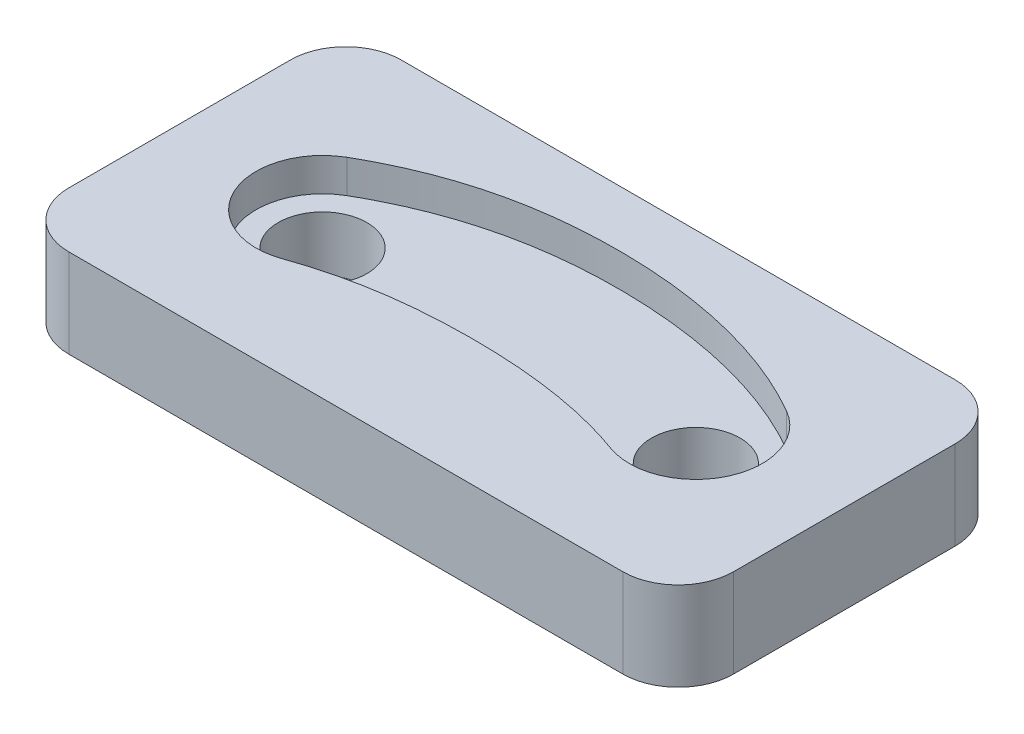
from build123d import *

# Parameters (mm, degrees)
EXTRUDE_1_DEPTH     = 26
CUT_EXTRUDE_1_DEPTH = 15
CUT_EXTRUDE_2_DEPTH = 13
CUT_EXTRUDE_3_DEPTH = 3
SKETCH_4_R          = 4
CUT_EXTRUDE_4_DEPTH = 5
CUT_EXTRUDE_5_DEPTH = 68.178330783
SKETCH_7_W          = 68.842653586
SKETCH_7_H          = 38.311408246
CUT_EXTRUDE_7_DEPTH = 3


with BuildPart() as part:
    # Sketch 1 → Extrude 1 (new body)
    with BuildSketch(Plane(origin=(0, 0, 0), x_dir=(1, 0, 0), z_dir=(0, 1, 0))):
        with BuildLine():
            ThreePointArc((-36.372007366, 5.05801105), (-33.443075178, 12.129078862), (-26.372007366, 15.05801105))
            Line((-26.372007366, 15.05801105), (32.627992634, 15.05801105))
            ThreePointArc((32.627992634, 15.05801105), (39.699060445, 12.129078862), (42.627992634, 5.05801105))
            Line((42.627992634, 5.05801105), (42.627992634, -34.94198895))
            ThreePointArc((42.627992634, -34.94198895), (39.699060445, -42.013056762), (32.627992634, -44.94198895))
            Line((32.627992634, -44.94198895), (-26.372007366, -44.94198895))
            ThreePointArc((-26.372007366, -44.94198895), (-33.443075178, -42.013056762), (-36.372007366, -34.94198895))
            Line((-36.372007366, -34.94198895), (-36.372007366, 5.05801105))
        make_face()
    extrude(amount=EXTRUDE_1_DEPTH)

    # Sketch 2 → Cut-Extrude 1 (cut)
    with BuildSketch(Plane(origin=(0, 26, 0), x_dir=(1, 0, 0), z_dir=(0, 1, 0))):
        with BuildLine():
            Line((28.127992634, -37.94198895), (-21.872007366, -37.94198895))
            ThreePointArc((-21.872007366, -37.94198895), (-25.407541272, -36.477522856), (-26.872007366, -32.94198895))
            Line((-26.872007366, -32.94198895), (-26.872007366, -12.94198895))
            ThreePointArc((-26.872007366, -12.94198895), (-25.407541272, -9.406455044), (-21.872007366, -7.94198895))
            Line((-21.872007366, -7.94198895), (28.127992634, -7.94198895))
            ThreePointArc((28.127992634, -7.94198895), (31.663526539, -9.406455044), (33.127992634, -12.94198895))
            Line((33.127992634, -12.94198895), (33.127992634, -32.94198895))
            ThreePointArc((33.127992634, -32.94198895), (31.663526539, -36.477522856), (28.127992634, -37.94198895))
        make_face()
    extrude(amount=-CUT_EXTRUDE_1_DEPTH, mode=Mode.SUBTRACT)

    # Sketch 2_5 → Cut-Extrude 2 (cut)
    with BuildSketch(Plane(origin=(0, 26, 0), x_dir=(1, 0, 0), z_dir=(0, 1, 0))):
        with BuildLine():
            Line((-19.372007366, -7.94198895), (25.627992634, -7.94198895))
            Line((25.627992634, -7.94198895), (25.627992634, 2.05801105))
            ThreePointArc((25.627992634, 2.05801105), (24.163526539, 5.593544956), (20.627992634, 7.05801105))
            Line((20.627992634, 7.05801105), (-14.372007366, 7.05801105))
            ThreePointArc((-14.372007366, 7.05801105), (-17.907541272, 5.593544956), (-19.372007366, 2.05801105))
            Line((-19.372007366, 2.05801105), (-19.372007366, -7.94198895))
        make_face()
    extrude(amount=-CUT_EXTRUDE_2_DEPTH, mode=Mode.SUBTRACT)

    # Sketch 3 → Cut-Extrude 3 (cut)
    with BuildSketch(Plane(origin=(0, 11, 0), x_dir=(1, 0, 0), z_dir=(0, 1, 0))):
        with BuildLine():
            ThreePointArc((-16.715889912, -17.999323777), (-19.160677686, -25.716247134), (-11.694757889, -28.844814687))
            add(Edge.make_bspline(
                [(-11.694757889, -28.844814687), (-7.070667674, -27.190479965), (2.758354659, -25.914696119), (13.021491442, -27.05610032), (17.925131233, -28.835586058)],
                knots=[0.146877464, 0.146877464, 0.146877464, 0.146877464, 0.498521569, 0.873518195, 0.873518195, 0.873518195, 0.873518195], degree=3))
            ThreePointArc((17.925131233, -28.835586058), (25.410930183, -25.728592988), (22.971875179, -17.999323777))
            add(Edge.make_bspline(
                [(-16.715889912, -17.999323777), (-10.305938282, -14.298536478), (2.976905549, -11.649443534), (16.864097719, -14.472996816), (22.971875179, -17.999323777)],
                knots=[0, 0, 0, 0, 0.5, 1, 1, 1, 1], degree=3))
        make_face()
    extrude(amount=-CUT_EXTRUDE_3_DEPTH, mode=Mode.SUBTRACT)

    # Sketch 4 → Cut-Extrude 4 (cut)
    with BuildSketch(Plane(origin=(0, 8, 0), x_dir=(1, 0, 0), z_dir=(0, 1, 0))):
        with Locations(Location((-13.715889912, -23.1954762, 0), (0, 0, 270))):
            Circle(SKETCH_4_R)
        with Locations(Location((19.971875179, -23.1954762, 0), (0, 0, 270))):
            Circle(SKETCH_4_R)
    extrude(amount=-CUT_EXTRUDE_4_DEPTH, mode=Mode.SUBTRACT)

    # Sketch 2_6 → Cut-Extrude 5 (cut, through all)
    # profile 1 of 2: a face of its own
    with BuildSketch(Plane(origin=(0, 26, 0), x_dir=(1, 0, 0), z_dir=(0, 1, 0))):
        with BuildLine():
            Line((32.627992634, 15.05801105), (-26.372007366, 15.05801105))
            ThreePointArc((-26.372007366, 15.05801105), (-33.443075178, 12.129078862), (-36.372007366, 5.05801105))
            Line((-36.372007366, 5.05801105), (-36.372007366, -34.94198895))
            ThreePointArc((-36.372007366, -34.94198895), (-33.443075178, -42.013056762), (-26.372007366, -44.94198895))
            Line((-26.372007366, -44.94198895), (32.627992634, -44.94198895))
            ThreePointArc((32.627992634, -44.94198895), (39.699060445, -42.013056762), (42.627992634, -34.94198895))
            Line((42.627992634, -34.94198895), (42.627992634, 5.05801105))
            ThreePointArc((42.627992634, 5.05801105), (39.699060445, 12.129078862), (32.627992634, 15.05801105))
        make_face()
        with BuildLine():
            ThreePointArc((33.127992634, -32.94198895), (31.663526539, -36.477522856), (28.127992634, -37.94198895))
            Line((28.127992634, -37.94198895), (-21.872007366, -37.94198895))
            ThreePointArc((-21.872007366, -37.94198895), (-25.407541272, -36.477522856), (-26.872007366, -32.94198895))
            Line((-26.872007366, -32.94198895), (-26.872007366, -12.94198895))
            ThreePointArc((-26.872007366, -12.94198895), (-25.407541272, -9.406455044), (-21.872007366, -7.94198895))
            Line((-21.872007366, -7.94198895), (-19.372007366, -7.94198895))
            Line((-19.372007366, -7.94198895), (-19.372007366, 2.05801105))
            ThreePointArc((-19.372007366, 2.05801105), (-17.907541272, 5.593544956), (-14.372007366, 7.05801105))
            Line((-14.372007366, 7.05801105), (20.627992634, 7.05801105))
            ThreePointArc((20.627992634, 7.05801105), (24.163526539, 5.593544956), (25.627992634, 2.05801105))
            Line((25.627992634, 2.05801105), (25.627992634, -7.94198895))
            Line((25.627992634, -7.94198895), (28.127992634, -7.94198895))
            ThreePointArc((28.127992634, -7.94198895), (31.663526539, -9.406455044), (33.127992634, -12.94198895))
            Line((33.127992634, -12.94198895), (33.127992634, -32.94198895))
        make_face(mode=Mode.SUBTRACT)
    # profile 2 of 2: a face of its own
    with BuildSketch(Plane(origin=(0, 26, 0), x_dir=(1, 0, 0), z_dir=(0, 1, 0))):
        with BuildLine():
            Line((-19.372007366, -7.94198895), (25.627992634, -7.94198895))
            Line((25.627992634, -7.94198895), (25.627992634, 2.05801105))
            ThreePointArc((25.627992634, 2.05801105), (24.163526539, 5.593544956), (20.627992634, 7.05801105))
            Line((20.627992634, 7.05801105), (-14.372007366, 7.05801105))
            ThreePointArc((-14.372007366, 7.05801105), (-17.907541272, 5.593544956), (-19.372007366, 2.05801105))
            Line((-19.372007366, 2.05801105), (-19.372007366, -7.94198895))
        make_face()
    extrude(amount=-CUT_EXTRUDE_5_DEPTH, mode=Mode.SUBTRACT)

    # Sketch 7 → Cut-Extrude 7 (cut)
    with BuildSketch(Plane.XZ):
        with Locations((3.186933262, 23.384043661)):
            Rectangle(SKETCH_7_W, SKETCH_7_H)
    extrude(amount=-CUT_EXTRUDE_7_DEPTH, mode=Mode.SUBTRACT)


solid = part.part
